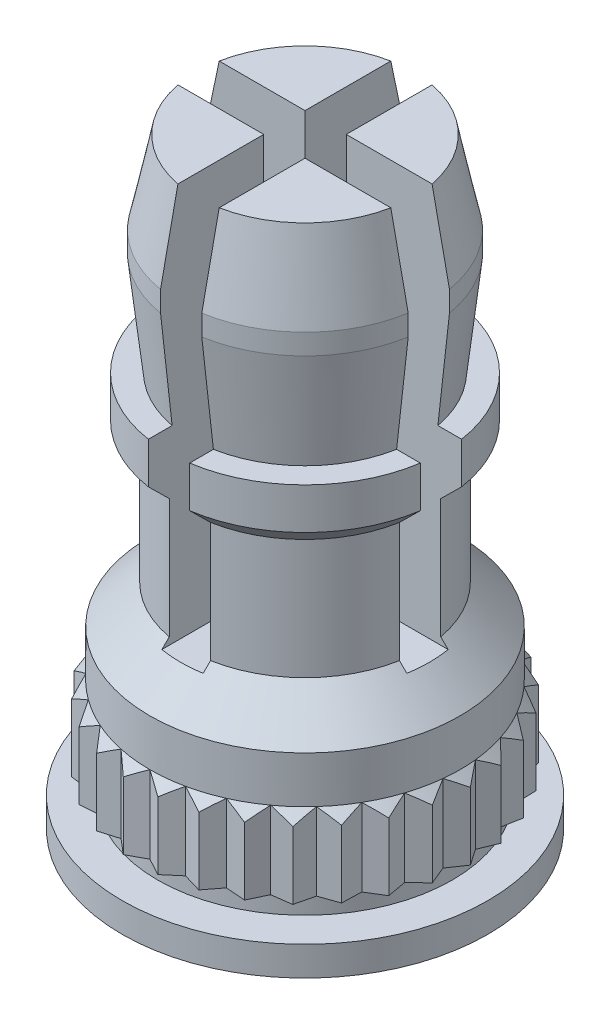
from build123d import *

# Parameters (mm, degrees)
SLITCUTSKE_W       = 5.336948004
SLITCUTSKE_H       = 0.71628
SLITCUT_DEPTH      = 6.860032
SLITCUTPAT_COUNT   = 2
SLITCUTPAT_ANGLE   = 90
CLINCHCUT_START    = -1.3462
CLINCHCUT_DEPTH    = 1.3462
CLINCHCUTPAT_COUNT = 30
CLINCHCUTPAT_ANGLE = 348


with BuildPart() as part:
    # BodySke → Body (revolve)
    with BuildSketch(Plane.XY, mode=Mode.PRIVATE) as body_sk:
        Polygon((2.55778, 0), (2.55778, 0.381), (2.8702, 0.381), (2.8702, 1.5494), (2.6924, 1.7272), (2.6924, 2.535428), (2.02946, 3.198368), (2.02946, 5.27558), (2.3876, 5.63372), (2.3876, 6.35), (1.9812, 6.35), (2.17932, 8.1407), (2.17932, 8.49884), (1.88214, 9.9314), (0, 9.9314), (0, -0.508), (3.175, -0.508), (3.175, 0), align=None)
    revolve(body_sk.sketch.rotate(Axis((0, -0.508, 0), (0, 1, 0)), 90), axis=Axis((0, -0.508, 0), (0, 1, 0)))

    # SlitCutSke → SlitCut (cut)
    with BuildSketch(Plane(origin=(0, 9.9314, 0), x_dir=(-1, 0, 0), z_dir=(0, 1, 0))):
        Rectangle(SLITCUTSKE_W, SLITCUTSKE_H)
    slitcut = extrude(amount=-SLITCUT_DEPTH, mode=Mode.SUBTRACT)

    # SlitCutPat: SlitCut ×2 about axis
    slitcutpat_axis = Axis((0, -0.508, 0), (0, 1, 0))
    for i in range(1, SLITCUTPAT_COUNT):
        add(slitcut.rotate(slitcutpat_axis, i * SLITCUTPAT_ANGLE / (SLITCUTPAT_COUNT - 1)), mode=Mode.SUBTRACT)

    # CliRinCutSke → ClinchCut (cut)
    with BuildSketch(Plane.XZ.offset(-0.381).offset(CLINCHCUT_START)):
        with BuildLine():
            Line((0.300017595, 2.854476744), (0, 2.6924))
            Line((0, 2.6924), (-0.300017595, 2.854476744))
            ThreePointArc((-0.300017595, 2.854476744), (0, 2.8702), (0.300017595, 2.854476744))
        make_face()
    clinchcut = extrude(amount=CLINCHCUT_DEPTH, mode=Mode.SUBTRACT)

    # ClinchCutPat: ClinchCut ×30 about axis
    clinchcutpat_axis = Axis((0, -0.508, 0), (0, 1, 0))
    for i in range(1, CLINCHCUTPAT_COUNT):
        add(clinchcut.rotate(clinchcutpat_axis, i * CLINCHCUTPAT_ANGLE / (CLINCHCUTPAT_COUNT - 1)), mode=Mode.SUBTRACT)


solid = part.part
